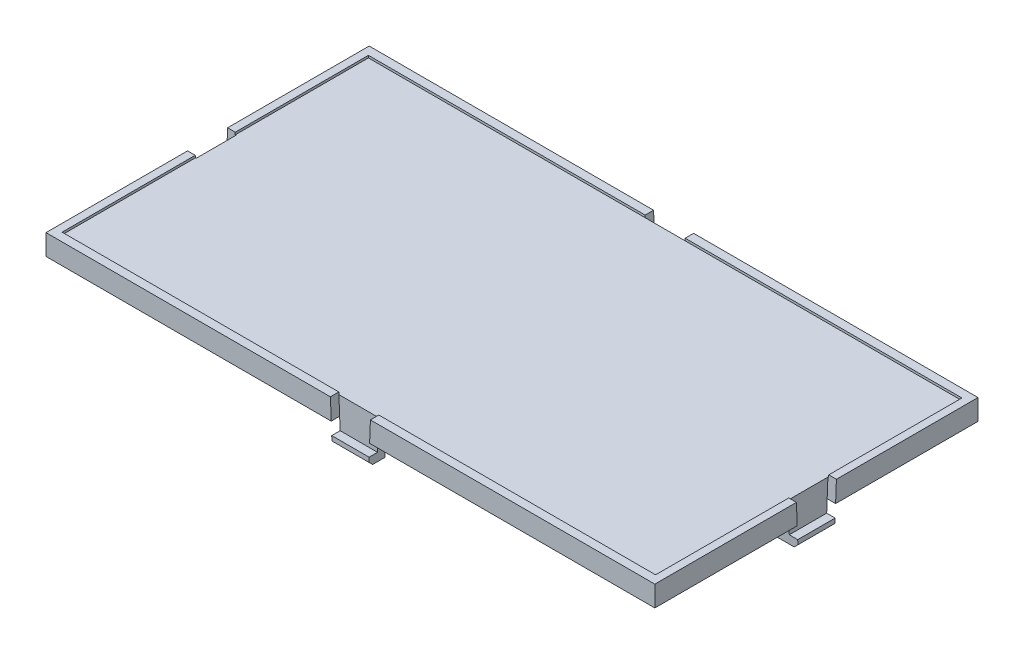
from build123d import *

# Parameters (mm, degrees)
SKETCH_1_W          = 79.5
SKETCH_1_H          = 42.2
EXTRUDE_1_DEPTH     = 2.7
SKETCH_2_W          = 77.5
SKETCH_2_H          = 40
CUT_EXTRUDE_1_DEPTH = 0.3
SKETCH_3_W          = 74.4
SKETCH_3_H          = 38
CUT_EXTRUDE_2_DEPTH = 0.3
EXTRUDE_2_DEPTH     = 2.65
CUT_EXTRUDE_4_DEPTH = 1.1
CUT_EXTRUDE_5_DEPTH = 3
EXTRUDE_3_DEPTH     = 2.1
CUT_EXTRUDE_6_DEPTH = 1.1
CUT_EXTRUDE_7_DEPTH = 3


with BuildPart() as part:
    # Sketch 1 → Extrude 1 (new body)
    with BuildSketch(Plane(origin=(0, 0, 0), x_dir=(1, 0, 0), z_dir=(0, 1, 0))):
        Rectangle(SKETCH_1_W, SKETCH_1_H)
    extrude(amount=EXTRUDE_1_DEPTH)

    # Sketch 2 → Cut-Extrude 1 (cut)
    with BuildSketch(Plane(origin=(0, 2.7, 0), x_dir=(1, 0, 0), z_dir=(0, 1, 0))):
        Rectangle(SKETCH_2_W, SKETCH_2_H)
    extrude(amount=-CUT_EXTRUDE_1_DEPTH, mode=Mode.SUBTRACT)

    # Sketch 3 → Cut-Extrude 2 (cut)
    with BuildSketch(Plane.XZ):
        Rectangle(SKETCH_3_W, SKETCH_3_H)
    extrude(amount=-CUT_EXTRUDE_2_DEPTH, mode=Mode.SUBTRACT)

    # Sketch 4 → Extrude 2 (add)
    with BuildSketch(Plane.ZY.offset(39.75)):
        Polygon((-2.6, 2.4), (2.6, 2.4), (2.4, -2.7), (-2.4, -2.7), align=None)
    extrude_2 = extrude(amount=-EXTRUDE_2_DEPTH)

    # Sketch 5 → Cut-Extrude 4 (cut)
    with BuildSketch(Plane.ZY.offset(39.75)):
        Polygon((-2.443137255, -1.6), (2.443137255, -1.6), (2.611764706, 2.7), (-2.611764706, 2.7), align=None)
    cut_extrude_4 = extrude(amount=-CUT_EXTRUDE_4_DEPTH, mode=Mode.SUBTRACT)

    # Sketch 6 → Cut-Extrude 5 (cut, symmetric)
    with BuildSketch(Plane.XY):
        Polygon((-39.75, -2.2), (-39.75, -2.7), (-39.25, -2.7), align=None)
    cut_extrude_5 = extrude(amount=CUT_EXTRUDE_5_DEPTH, both=True, mode=Mode.SUBTRACT)

    # Sketch 7 → Extrude 3 (add)
    with BuildSketch(Plane.XY.offset(21.1)):
        Polygon((-2.6, 2.4), (2.6, 2.4), (2.4, -2.7), (-2.4, -2.7), align=None)
    extrude_3 = extrude(amount=-EXTRUDE_3_DEPTH)

    # Sketch 8 → Cut-Extrude 6 (cut)
    with BuildSketch(Plane.XY.offset(21.1)):
        Polygon((-2.443137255, -1.6), (-2.611764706, 2.7), (2.611764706, 2.7), (2.443137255, -1.6), align=None)
    cut_extrude_6 = extrude(amount=-CUT_EXTRUDE_6_DEPTH, mode=Mode.SUBTRACT)

    # Sketch 9 → Cut-Extrude 7 (cut, symmetric)
    with BuildSketch(Plane(origin=(0, -54.3, 0), x_dir=(0, 0, -1), z_dir=(1, 0, 0))):
        Polygon((-21.1, 51.6), (-21.1, 52.1), (-20.6, 51.6), align=None)
    cut_extrude_7 = extrude(amount=CUT_EXTRUDE_7_DEPTH, both=True, mode=Mode.SUBTRACT)

    # Mirror 3: Extrude 3, Cut-Extrude 6, Cut-Extrude 7 across plane
    add(extrude_3.mirror(Plane.XY))
    add(cut_extrude_6.mirror(Plane.XY), mode=Mode.SUBTRACT)
    add(cut_extrude_7.mirror(Plane.XY), mode=Mode.SUBTRACT)

    # Mirror 4: Extrude 2, Cut-Extrude 4, Cut-Extrude 5 across plane
    add(extrude_2.mirror(Plane(origin=(0, 0, 0), x_dir=(0, 0, 1), z_dir=(1, 0, 0))))
    add(cut_extrude_4.mirror(Plane(origin=(0, 0, 0), x_dir=(0, 0, 1), z_dir=(1, 0, 0))), mode=Mode.SUBTRACT)
    add(cut_extrude_5.mirror(Plane(origin=(0, 0, 0), x_dir=(0, 0, 1), z_dir=(1, 0, 0))), mode=Mode.SUBTRACT)


solid = part.part
